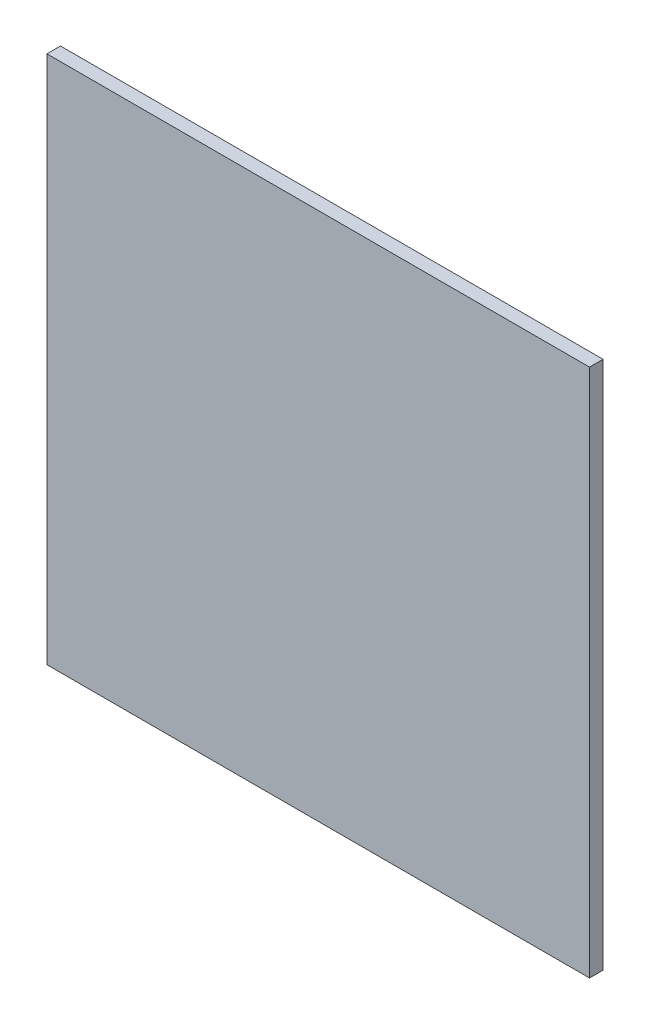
from build123d import *

# Parameters (mm, degrees)
CROQUIS1_W              = 600
CROQUIS1_H              = 585
SALIENTE_EXTRUIR1_DEPTH = 15


with BuildPart() as part:
    # Croquis1 → Saliente-Extruir1 (new body)
    with BuildSketch(Plane.XY):
        Rectangle(CROQUIS1_W, CROQUIS1_H)
    extrude(amount=SALIENTE_EXTRUIR1_DEPTH)


solid = part.part
